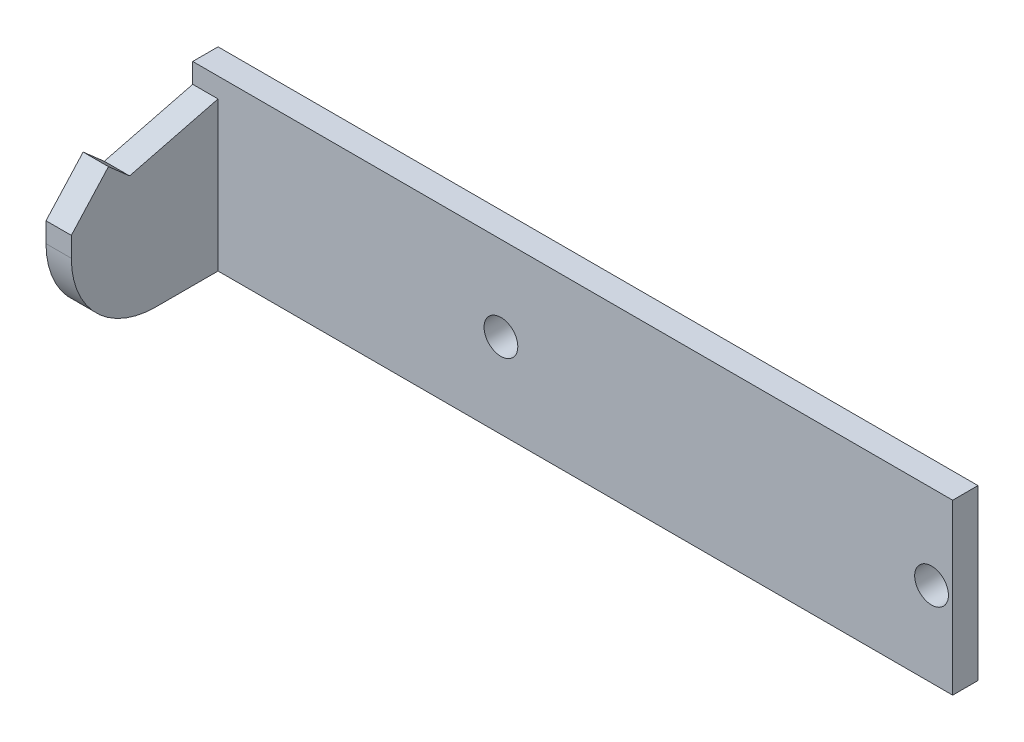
ISO-10303-21;
HEADER;
FILE_DESCRIPTION(('STEP AP214'),'2;1');
FILE_NAME('part.step','',(''),(''),'','','');
FILE_SCHEMA(('AUTOMOTIVE_DESIGN { 1 0 10303 214 1 1 1 1 }'));
ENDSEC;
DATA;
#1=APPLICATION_CONTEXT('core data for automotive mechanical design processes');
#2=APPLICATION_PROTOCOL_DEFINITION('international standard','automotive_design',2000,#1);
#3=PRODUCT_CONTEXT('',#1,'mechanical');
#4=PRODUCT('Part','Part','',(#3));
#5=PRODUCT_RELATED_PRODUCT_CATEGORY('part','',(#4));
#6=PRODUCT_DEFINITION_FORMATION('','',#4);
#7=PRODUCT_DEFINITION_CONTEXT('part definition',#1,'design');
#8=PRODUCT_DEFINITION('design','',#6,#7);
#9=PRODUCT_DEFINITION_SHAPE('','',#8);
#10=(LENGTH_UNIT() NAMED_UNIT(*) SI_UNIT(.MILLI.,.METRE.));
#11=(NAMED_UNIT(*) PLANE_ANGLE_UNIT() SI_UNIT($,.RADIAN.));
#12=(NAMED_UNIT(*) SI_UNIT($,.STERADIAN.) SOLID_ANGLE_UNIT());
#13=UNCERTAINTY_MEASURE_WITH_UNIT(LENGTH_MEASURE(1.E-05),#10,'distance_accuracy_value','');
#14=(GEOMETRIC_REPRESENTATION_CONTEXT(3) GLOBAL_UNCERTAINTY_ASSIGNED_CONTEXT((#13)) GLOBAL_UNIT_ASSIGNED_CONTEXT((#10,
#11,#12)) REPRESENTATION_CONTEXT('',''));
#15=CARTESIAN_POINT('',(0.,0.,0.));
#16=DIRECTION('',(0.,0.,1.));
#17=DIRECTION('',(1.,0.,0.));
#18=AXIS2_PLACEMENT_3D('',#15,#16,#17);
#19=CARTESIAN_POINT('',(-20.,-2.7997929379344,12.979015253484));
#20=DIRECTION('',(0.,0.750900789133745,-0.660415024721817));
#21=DIRECTION('',(1.,0.,0.));
#22=AXIS2_PLACEMENT_3D('',#19,#20,#21);
#23=PLANE('',#22);
#24=DIRECTION('',(0.,0.660415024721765,0.750900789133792));
#25=VECTOR('',#24,1.);
#26=CARTESIAN_POINT('',(-17.,-5.00000000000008,10.4773501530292));
#27=LINE('',#26,#25);
#28=CARTESIAN_POINT('',(-17.,-5.00000000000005,10.4773501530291));
#29=VERTEX_POINT('',#28);
#30=CARTESIAN_POINT('',(-17.,-2.79979293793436,12.9790152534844));
#31=VERTEX_POINT('',#30);
#32=EDGE_CURVE('E98',#29,#31,#27,.T.);
#33=ORIENTED_EDGE('',*,*,#32,.F.);
#34=DIRECTION('',(1.,0.,0.));
#35=VECTOR('',#34,1.);
#36=CARTESIAN_POINT('',(-14.595943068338,-5.,10.477350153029));
#37=LINE('',#36,#35);
#38=CARTESIAN_POINT('',(-20.,-5.,10.477350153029));
#39=VERTEX_POINT('',#38);
#40=EDGE_CURVE('E112',#39,#29,#37,.T.);
#41=ORIENTED_EDGE('',*,*,#40,.F.);
#42=DIRECTION('',(0.,-0.660415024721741,-0.750900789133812));
#43=VECTOR('',#42,1.);
#44=CARTESIAN_POINT('',(-20.,-2.79979293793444,12.9790152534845));
#45=LINE('',#44,#43);
#46=CARTESIAN_POINT('',(-20.,-2.79979293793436,12.9790152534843));
#47=VERTEX_POINT('',#46);
#48=EDGE_CURVE('E99',#47,#39,#45,.T.);
#49=ORIENTED_EDGE('',*,*,#48,.F.);
#50=DIRECTION('',(-1.,0.,0.));
#51=VECTOR('',#50,1.);
#52=CARTESIAN_POINT('',(-16.7261811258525,-2.7997929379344,12.979015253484));
#53=LINE('',#52,#51);
#54=EDGE_CURVE('E95',#31,#47,#53,.T.);
#55=ORIENTED_EDGE('',*,*,#54,.F.);
#56=EDGE_LOOP('',(#33,#41,#49,#55));
#57=FACE_BOUND('',#56,.T.);
#58=ADVANCED_FACE('F16',(#57),#23,.T.);
#59=CARTESIAN_POINT('',(-20.,-7.6515070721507,17.375881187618));
#60=DIRECTION('',(0.,0.6715194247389,0.740986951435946));
#61=DIRECTION('',(1.,0.,0.));
#62=AXIS2_PLACEMENT_3D('',#59,#60,#61);
#63=PLANE('',#62);
#64=DIRECTION('',(0.,-0.740986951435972,0.671519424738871));
#65=VECTOR('',#64,1.);
#66=CARTESIAN_POINT('',(-17.,-2.79979293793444,12.9790152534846));
#67=LINE('',#66,#65);
#68=CARTESIAN_POINT('',(-17.,-7.65150707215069,17.3758811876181));
#69=VERTEX_POINT('',#68);
#70=EDGE_CURVE('E103',#31,#69,#67,.T.);
#71=ORIENTED_EDGE('',*,*,#70,.F.);
#72=ORIENTED_EDGE('',*,*,#54,.T.);
#73=DIRECTION('',(0.,0.740986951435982,-0.67151942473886));
#74=VECTOR('',#73,1.);
#75=CARTESIAN_POINT('',(-20.,-7.65150707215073,17.375881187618));
#76=LINE('',#75,#74);
#77=CARTESIAN_POINT('',(-20.,-7.65150707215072,17.375881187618));
#78=VERTEX_POINT('',#77);
#79=EDGE_CURVE('E117',#78,#47,#76,.T.);
#80=ORIENTED_EDGE('',*,*,#79,.F.);
#81=DIRECTION('',(-1.,0.,0.));
#82=VECTOR('',#81,1.);
#83=CARTESIAN_POINT('',(-18.5,-7.65150707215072,17.375881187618));
#84=LINE('',#83,#82);
#85=EDGE_CURVE('E89',#69,#78,#84,.T.);
#86=ORIENTED_EDGE('',*,*,#85,.F.);
#87=EDGE_LOOP('',(#71,#72,#80,#86));
#88=FACE_BOUND('',#87,.T.);
#89=ADVANCED_FACE('F104',(#88),#63,.T.);
#90=CARTESIAN_POINT('',(-20.,-10.,17.375881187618));
#91=DIRECTION('',(0.,0.,1.));
#92=DIRECTION('',(1.,0.,0.));
#93=AXIS2_PLACEMENT_3D('',#90,#91,#92);
#94=PLANE('',#93);
#95=DIRECTION('',(0.,-1.,0.));
#96=VECTOR('',#95,1.);
#97=CARTESIAN_POINT('',(-17.,-11.1733068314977,17.3758811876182));
#98=LINE('',#97,#96);
#99=CARTESIAN_POINT('',(-17.,-9.99999999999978,17.375881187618));
#100=VERTEX_POINT('',#99);
#101=EDGE_CURVE('E107',#69,#100,#98,.T.);
#102=ORIENTED_EDGE('',*,*,#101,.F.);
#103=ORIENTED_EDGE('',*,*,#85,.T.);
#104=DIRECTION('',(0.,1.,0.));
#105=VECTOR('',#104,1.);
#106=CARTESIAN_POINT('',(-20.,-10.187940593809,17.375881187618));
#107=LINE('',#106,#105);
#108=CARTESIAN_POINT('',(-20.,-9.99999999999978,17.3758811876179));
#109=VERTEX_POINT('',#108);
#110=EDGE_CURVE('E118',#109,#78,#107,.T.);
#111=ORIENTED_EDGE('',*,*,#110,.F.);
#112=DIRECTION('',(1.,0.,0.));
#113=VECTOR('',#112,1.);
#114=CARTESIAN_POINT('',(-18.5,-9.99999999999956,17.3758811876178));
#115=LINE('',#114,#113);
#116=EDGE_CURVE('E139',#109,#100,#115,.T.);
#117=ORIENTED_EDGE('',*,*,#116,.T.);
#118=EDGE_LOOP('',(#102,#103,#111,#117));
#119=FACE_BOUND('',#118,.T.);
#120=ADVANCED_FACE('F278',(#119),#94,.T.);
#121=CARTESIAN_POINT('',(-20.,-10.,7.3758811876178));
#122=DIRECTION('',(1.,0.,0.));
#123=DIRECTION('',(0.,0.,-1.));
#124=AXIS2_PLACEMENT_3D('',#121,#122,#123);
#125=CYLINDRICAL_SURFACE('',#124,10.);
#126=CARTESIAN_POINT('',(-20.,-10.,7.3758811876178));
#127=DIRECTION('',(1.,0.,0.));
#128=DIRECTION('',(0.,0.,-1.));
#129=AXIS2_PLACEMENT_3D('',#126,#127,#128);
#130=CIRCLE('',#129,10.);
#131=CARTESIAN_POINT('',(-20.,-20.0000000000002,7.3758811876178));
#132=VERTEX_POINT('',#131);
#133=EDGE_CURVE('E20',#132,#109,#130,.F.);
#134=ORIENTED_EDGE('',*,*,#133,.F.);
#135=DIRECTION('',(-1.,0.,0.));
#136=VECTOR('',#135,1.);
#137=CARTESIAN_POINT('',(25.,-20.,7.3758811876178));
#138=LINE('',#137,#136);
#139=CARTESIAN_POINT('',(-17.,-20.,7.3758811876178));
#140=VERTEX_POINT('',#139);
#141=EDGE_CURVE('E61',#140,#132,#138,.T.);
#142=ORIENTED_EDGE('',*,*,#141,.F.);
#143=CARTESIAN_POINT('',(-17.,-10.,7.3758811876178));
#144=DIRECTION('',(1.,0.,0.));
#145=DIRECTION('',(0.,0.,-1.));
#146=AXIS2_PLACEMENT_3D('',#143,#144,#145);
#147=CIRCLE('',#146,10.);
#148=EDGE_CURVE('E134',#100,#140,#147,.T.);
#149=ORIENTED_EDGE('',*,*,#148,.F.);
#150=ORIENTED_EDGE('',*,*,#116,.F.);
#151=EDGE_LOOP('',(#134,#142,#149,#150));
#152=FACE_BOUND('',#151,.T.);
#153=ADVANCED_FACE('F225',(#152),#125,.T.);
#154=CARTESIAN_POINT('',(70.,-20.,-3.));
#155=DIRECTION('',(0.,0.,-1.));
#156=DIRECTION('',(-1.,0.,0.));
#157=AXIS2_PLACEMENT_3D('',#154,#155,#156);
#158=PLANE('',#157);
#159=CARTESIAN_POINT('',(16.5,-10.,-3.));
#160=DIRECTION('',(0.,0.,1.));
#161=DIRECTION('',(1.,0.,0.));
#162=AXIS2_PLACEMENT_3D('',#159,#160,#161);
#163=CIRCLE('',#162,2.);
#164=CARTESIAN_POINT('',(18.5,-10.,-3.));
#165=VERTEX_POINT('',#164);
#166=EDGE_CURVE('E144',#165,#165,#163,.F.);
#167=ORIENTED_EDGE('',*,*,#166,.F.);
#168=EDGE_LOOP('',(#167));
#169=FACE_BOUND('',#168,.T.);
#170=CARTESIAN_POINT('',(67.5,-10.,-3.));
#171=DIRECTION('',(0.,0.,1.));
#172=DIRECTION('',(1.,0.,0.));
#173=AXIS2_PLACEMENT_3D('',#170,#171,#172);
#174=CIRCLE('',#173,2.);
#175=CARTESIAN_POINT('',(69.5,-10.,-3.));
#176=VERTEX_POINT('',#175);
#177=EDGE_CURVE('E133',#176,#176,#174,.F.);
#178=ORIENTED_EDGE('',*,*,#177,.F.);
#179=EDGE_LOOP('',(#178));
#180=FACE_BOUND('',#179,.T.);
#181=DIRECTION('',(0.,1.,0.));
#182=VECTOR('',#181,1.);
#183=CARTESIAN_POINT('',(70.,-10.,-3.));
#184=LINE('',#183,#182);
#185=CARTESIAN_POINT('',(70.,-20.,-3.00000000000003));
#186=VERTEX_POINT('',#185);
#187=CARTESIAN_POINT('',(70.,0.,-2.99999999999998));
#188=VERTEX_POINT('',#187);
#189=EDGE_CURVE('E194',#186,#188,#184,.T.);
#190=ORIENTED_EDGE('',*,*,#189,.F.);
#191=DIRECTION('',(1.,0.,0.));
#192=VECTOR('',#191,1.);
#193=CARTESIAN_POINT('',(25.,-20.,-3.00000000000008));
#194=LINE('',#193,#192);
#195=CARTESIAN_POINT('',(-20.,-20.0000000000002,-3.00000000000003));
#196=VERTEX_POINT('',#195);
#197=EDGE_CURVE('E71',#196,#186,#194,.T.);
#198=ORIENTED_EDGE('',*,*,#197,.F.);
#199=DIRECTION('',(0.,-1.,0.));
#200=VECTOR('',#199,1.);
#201=CARTESIAN_POINT('',(-20.,-10.187940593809,-3.));
#202=LINE('',#201,#200);
#203=CARTESIAN_POINT('',(-20.,0.,-2.99999999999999));
#204=VERTEX_POINT('',#203);
#205=EDGE_CURVE('E128',#204,#196,#202,.T.);
#206=ORIENTED_EDGE('',*,*,#205,.F.);
#207=DIRECTION('',(-1.,0.,0.));
#208=VECTOR('',#207,1.);
#209=CARTESIAN_POINT('',(25.,0.,-2.99999999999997));
#210=LINE('',#209,#208);
#211=EDGE_CURVE('E181',#188,#204,#210,.T.);
#212=ORIENTED_EDGE('',*,*,#211,.F.);
#213=EDGE_LOOP('',(#190,#198,#206,#212));
#214=FACE_BOUND('',#213,.T.);
#215=ADVANCED_FACE('F282',(#169,#180,#214),#158,.T.);
#216=CARTESIAN_POINT('',(-20.,-20.,7.3758811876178));
#217=DIRECTION('',(0.,-1.,0.));
#218=DIRECTION('',(0.,0.,-1.));
#219=AXIS2_PLACEMENT_3D('',#216,#217,#218);
#220=PLANE('',#219);
#221=ORIENTED_EDGE('',*,*,#197,.T.);
#222=DIRECTION('',(0.,0.,-1.));
#223=VECTOR('',#222,1.);
#224=CARTESIAN_POINT('',(70.,-20.,-10.));
#225=LINE('',#224,#223);
#226=CARTESIAN_POINT('',(70.,-20.,0.));
#227=VERTEX_POINT('',#226);
#228=EDGE_CURVE('E171',#227,#186,#225,.T.);
#229=ORIENTED_EDGE('',*,*,#228,.F.);
#230=DIRECTION('',(1.,0.,0.));
#231=VECTOR('',#230,1.);
#232=CARTESIAN_POINT('',(25.,-20.,0.));
#233=LINE('',#232,#231);
#234=CARTESIAN_POINT('',(-17.,-20.,0.));
#235=VERTEX_POINT('',#234);
#236=EDGE_CURVE('E140',#235,#227,#233,.T.);
#237=ORIENTED_EDGE('',*,*,#236,.F.);
#238=DIRECTION('',(0.,0.,-1.));
#239=VECTOR('',#238,1.);
#240=CARTESIAN_POINT('',(-17.,-20.,8.8266931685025));
#241=LINE('',#240,#239);
#242=EDGE_CURVE('E131',#140,#235,#241,.T.);
#243=ORIENTED_EDGE('',*,*,#242,.F.);
#244=ORIENTED_EDGE('',*,*,#141,.T.);
#245=DIRECTION('',(0.,0.,1.));
#246=VECTOR('',#245,1.);
#247=CARTESIAN_POINT('',(-20.,-20.0000000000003,7.187940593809));
#248=LINE('',#247,#246);
#249=EDGE_CURVE('E124',#196,#132,#248,.T.);
#250=ORIENTED_EDGE('',*,*,#249,.F.);
#251=EDGE_LOOP('',(#221,#229,#237,#243,#244,#250));
#252=FACE_BOUND('',#251,.T.);
#253=ADVANCED_FACE('F227',(#252),#220,.T.);
#254=CARTESIAN_POINT('',(70.,-20.,0.));
#255=DIRECTION('',(1.,0.,0.));
#256=DIRECTION('',(0.,0.,-1.));
#257=AXIS2_PLACEMENT_3D('',#254,#255,#256);
#258=PLANE('',#257);
#259=ORIENTED_EDGE('',*,*,#189,.T.);
#260=DIRECTION('',(0.,0.,-1.));
#261=VECTOR('',#260,1.);
#262=CARTESIAN_POINT('',(70.,0.,-45.));
#263=LINE('',#262,#261);
#264=CARTESIAN_POINT('',(70.,0.,0.));
#265=VERTEX_POINT('',#264);
#266=EDGE_CURVE('E185',#265,#188,#263,.T.);
#267=ORIENTED_EDGE('',*,*,#266,.F.);
#268=DIRECTION('',(0.,1.,0.));
#269=VECTOR('',#268,1.);
#270=CARTESIAN_POINT('',(70.,25.,0.));
#271=LINE('',#270,#269);
#272=EDGE_CURVE('E143',#227,#265,#271,.T.);
#273=ORIENTED_EDGE('',*,*,#272,.F.);
#274=ORIENTED_EDGE('',*,*,#228,.T.);
#275=EDGE_LOOP('',(#259,#267,#273,#274));
#276=FACE_BOUND('',#275,.T.);
#277=ADVANCED_FACE('F288',(#276),#258,.T.);
#278=CARTESIAN_POINT('',(70.,0.,0.));
#279=DIRECTION('',(0.,1.,0.));
#280=DIRECTION('',(0.,0.,-1.));
#281=AXIS2_PLACEMENT_3D('',#278,#279,#280);
#282=PLANE('',#281);
#283=ORIENTED_EDGE('',*,*,#211,.T.);
#284=DIRECTION('',(0.,0.,-1.));
#285=VECTOR('',#284,1.);
#286=CARTESIAN_POINT('',(-20.,0.,7.187940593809));
#287=LINE('',#286,#285);
#288=CARTESIAN_POINT('',(-20.,0.,0.));
#289=VERTEX_POINT('',#288);
#290=EDGE_CURVE('E176',#289,#204,#287,.T.);
#291=ORIENTED_EDGE('',*,*,#290,.F.);
#292=DIRECTION('',(-1.,0.,0.));
#293=VECTOR('',#292,1.);
#294=CARTESIAN_POINT('',(25.,-1.94289029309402E-13,0.));
#295=LINE('',#294,#293);
#296=EDGE_CURVE('E167',#265,#289,#295,.T.);
#297=ORIENTED_EDGE('',*,*,#296,.F.);
#298=ORIENTED_EDGE('',*,*,#266,.T.);
#299=EDGE_LOOP('',(#283,#291,#297,#298));
#300=FACE_BOUND('',#299,.T.);
#301=ADVANCED_FACE('F242',(#300),#282,.T.);
#302=CARTESIAN_POINT('',(-20.,0.,17.375881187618));
#303=DIRECTION('',(-1.,0.,0.));
#304=DIRECTION('',(0.,0.,-1.));
#305=AXIS2_PLACEMENT_3D('',#302,#303,#304);
#306=PLANE('',#305);
#307=ORIENTED_EDGE('',*,*,#48,.T.);
#308=DIRECTION('',(0.,-0.245499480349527,0.969396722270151));
#309=VECTOR('',#308,1.);
#310=CARTESIAN_POINT('',(-20.,-3.6733068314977,5.2386750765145));
#311=LINE('',#310,#309);
#312=CARTESIAN_POINT('',(-20.,-2.34661366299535,0.));
#313=VERTEX_POINT('',#312);
#314=EDGE_CURVE('E116',#313,#39,#311,.T.);
#315=ORIENTED_EDGE('',*,*,#314,.F.);
#316=DIRECTION('',(0.,-1.,0.));
#317=VECTOR('',#316,1.);
#318=CARTESIAN_POINT('',(-20.,25.,0.));
#319=LINE('',#318,#317);
#320=EDGE_CURVE('E158',#289,#313,#319,.T.);
#321=ORIENTED_EDGE('',*,*,#320,.F.);
#322=ORIENTED_EDGE('',*,*,#290,.T.);
#323=ORIENTED_EDGE('',*,*,#205,.T.);
#324=ORIENTED_EDGE('',*,*,#249,.T.);
#325=ORIENTED_EDGE('',*,*,#133,.T.);
#326=ORIENTED_EDGE('',*,*,#110,.T.);
#327=ORIENTED_EDGE('',*,*,#79,.T.);
#328=EDGE_LOOP('',(#307,#315,#321,#322,#323,#324,#325,#326,#327));
#329=FACE_BOUND('',#328,.T.);
#330=ADVANCED_FACE('F244',(#329),#306,.T.);
#331=CARTESIAN_POINT('',(-20.,-5.,10.477350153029));
#332=DIRECTION('',(0.,0.969396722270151,0.245499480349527));
#333=DIRECTION('',(1.,0.,0.));
#334=AXIS2_PLACEMENT_3D('',#331,#332,#333);
#335=PLANE('',#334);
#336=DIRECTION('',(0.,-0.245499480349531,0.96939672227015));
#337=VECTOR('',#336,1.);
#338=CARTESIAN_POINT('',(-17.,-2.3466136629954,0.));
#339=LINE('',#338,#337);
#340=CARTESIAN_POINT('',(-17.,-2.34661366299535,0.));
#341=VERTEX_POINT('',#340);
#342=EDGE_CURVE('E35',#341,#29,#339,.T.);
#343=ORIENTED_EDGE('',*,*,#342,.F.);
#344=DIRECTION('',(1.,0.,0.));
#345=VECTOR('',#344,1.);
#346=CARTESIAN_POINT('',(25.,-2.34661366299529,0.));
#347=LINE('',#346,#345);
#348=EDGE_CURVE('E150',#313,#341,#347,.T.);
#349=ORIENTED_EDGE('',*,*,#348,.F.);
#350=ORIENTED_EDGE('',*,*,#314,.T.);
#351=ORIENTED_EDGE('',*,*,#40,.T.);
#352=EDGE_LOOP('',(#343,#349,#350,#351));
#353=FACE_BOUND('',#352,.T.);
#354=ADVANCED_FACE('F245',(#353),#335,.T.);
#355=CARTESIAN_POINT('',(-17.,-2.3466136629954,0.));
#356=DIRECTION('',(1.,0.,0.));
#357=DIRECTION('',(0.,0.,1.));
#358=AXIS2_PLACEMENT_3D('',#355,#356,#357);
#359=PLANE('',#358);
#360=ORIENTED_EDGE('',*,*,#242,.T.);
#361=DIRECTION('',(0.,-1.,0.));
#362=VECTOR('',#361,1.);
#363=CARTESIAN_POINT('',(-17.,25.,0.));
#364=LINE('',#363,#362);
#365=EDGE_CURVE('E147',#341,#235,#364,.T.);
#366=ORIENTED_EDGE('',*,*,#365,.F.);
#367=ORIENTED_EDGE('',*,*,#342,.T.);
#368=ORIENTED_EDGE('',*,*,#32,.T.);
#369=ORIENTED_EDGE('',*,*,#70,.T.);
#370=ORIENTED_EDGE('',*,*,#101,.T.);
#371=ORIENTED_EDGE('',*,*,#148,.T.);
#372=EDGE_LOOP('',(#360,#366,#367,#368,#369,#370,#371));
#373=FACE_BOUND('',#372,.T.);
#374=ADVANCED_FACE('F110',(#373),#359,.T.);
#375=CARTESIAN_POINT('',(67.5,-10.,-3.));
#376=DIRECTION('',(0.,0.,1.));
#377=DIRECTION('',(1.,0.,0.));
#378=AXIS2_PLACEMENT_3D('',#375,#376,#377);
#379=CYLINDRICAL_SURFACE('',#378,2.);
#380=ORIENTED_EDGE('',*,*,#177,.T.);
#381=EDGE_LOOP('',(#380));
#382=FACE_BOUND('',#381,.T.);
#383=CARTESIAN_POINT('',(67.5,-10.,0.));
#384=DIRECTION('',(0.,0.,1.));
#385=DIRECTION('',(1.,0.,0.));
#386=AXIS2_PLACEMENT_3D('',#383,#384,#385);
#387=CIRCLE('',#386,2.);
#388=CARTESIAN_POINT('',(69.5,-10.,0.));
#389=VERTEX_POINT('',#388);
#390=EDGE_CURVE('E26',#389,#389,#387,.F.);
#391=ORIENTED_EDGE('',*,*,#390,.F.);
#392=EDGE_LOOP('',(#391));
#393=FACE_BOUND('',#392,.T.);
#394=ADVANCED_FACE('F253',(#382,#393),#379,.F.);
#395=CARTESIAN_POINT('',(16.5,-10.,-3.));
#396=DIRECTION('',(0.,0.,1.));
#397=DIRECTION('',(1.,0.,0.));
#398=AXIS2_PLACEMENT_3D('',#395,#396,#397);
#399=CYLINDRICAL_SURFACE('',#398,2.);
#400=ORIENTED_EDGE('',*,*,#166,.T.);
#401=EDGE_LOOP('',(#400));
#402=FACE_BOUND('',#401,.T.);
#403=CARTESIAN_POINT('',(16.5,-10.,0.));
#404=DIRECTION('',(0.,0.,1.));
#405=DIRECTION('',(1.,0.,0.));
#406=AXIS2_PLACEMENT_3D('',#403,#404,#405);
#407=CIRCLE('',#406,2.);
#408=CARTESIAN_POINT('',(18.5,-10.,0.));
#409=VERTEX_POINT('',#408);
#410=EDGE_CURVE('E11',#409,#409,#407,.F.);
#411=ORIENTED_EDGE('',*,*,#410,.F.);
#412=EDGE_LOOP('',(#411));
#413=FACE_BOUND('',#412,.T.);
#414=ADVANCED_FACE('F256',(#402,#413),#399,.F.);
#415=CARTESIAN_POINT('',(-20.,-20.,0.));
#416=DIRECTION('',(0.,0.,1.));
#417=DIRECTION('',(1.,0.,0.));
#418=AXIS2_PLACEMENT_3D('',#415,#416,#417);
#419=PLANE('',#418);
#420=ORIENTED_EDGE('',*,*,#410,.T.);
#421=EDGE_LOOP('',(#420));
#422=FACE_BOUND('',#421,.T.);
#423=ORIENTED_EDGE('',*,*,#390,.T.);
#424=EDGE_LOOP('',(#423));
#425=FACE_BOUND('',#424,.T.);
#426=ORIENTED_EDGE('',*,*,#348,.T.);
#427=ORIENTED_EDGE('',*,*,#365,.T.);
#428=ORIENTED_EDGE('',*,*,#236,.T.);
#429=ORIENTED_EDGE('',*,*,#272,.T.);
#430=ORIENTED_EDGE('',*,*,#296,.T.);
#431=ORIENTED_EDGE('',*,*,#320,.T.);
#432=EDGE_LOOP('',(#426,#427,#428,#429,#430,#431));
#433=FACE_BOUND('',#432,.T.);
#434=ADVANCED_FACE('F18',(#422,#425,#433),#419,.T.);
#435=CLOSED_SHELL('',(#58,#89,#120,#153,#215,#253,#277,#301,#330,#354,#374,#394,#414,#434));
#436=MANIFOLD_SOLID_BREP('B1',#435);
#437=ADVANCED_BREP_SHAPE_REPRESENTATION('',(#18,#436),#14);
#438=SHAPE_DEFINITION_REPRESENTATION(#9,#437);
ENDSEC;
END-ISO-10303-21;
